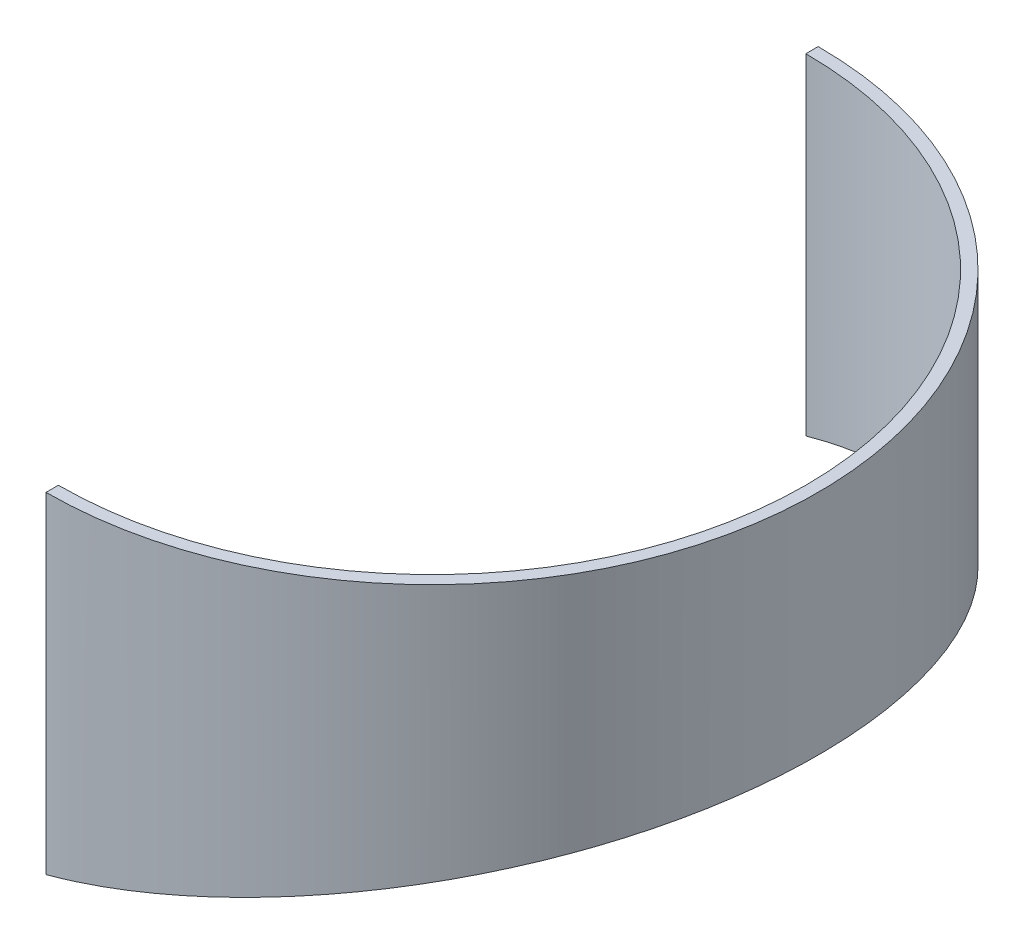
ISO-10303-21;
HEADER;
FILE_DESCRIPTION(('STEP AP214'),'2;1');
FILE_NAME('part.step','',(''),(''),'','','');
FILE_SCHEMA(('AUTOMOTIVE_DESIGN { 1 0 10303 214 1 1 1 1 }'));
ENDSEC;
DATA;
#1=APPLICATION_CONTEXT('core data for automotive mechanical design processes');
#2=APPLICATION_PROTOCOL_DEFINITION('international standard','automotive_design',2000,#1);
#3=PRODUCT_CONTEXT('',#1,'mechanical');
#4=PRODUCT('Part','Part','',(#3));
#5=PRODUCT_RELATED_PRODUCT_CATEGORY('part','',(#4));
#6=PRODUCT_DEFINITION_FORMATION('','',#4);
#7=PRODUCT_DEFINITION_CONTEXT('part definition',#1,'design');
#8=PRODUCT_DEFINITION('design','',#6,#7);
#9=PRODUCT_DEFINITION_SHAPE('','',#8);
#10=(LENGTH_UNIT() NAMED_UNIT(*) SI_UNIT(.MILLI.,.METRE.));
#11=(NAMED_UNIT(*) PLANE_ANGLE_UNIT() SI_UNIT($,.RADIAN.));
#12=(NAMED_UNIT(*) SI_UNIT($,.STERADIAN.) SOLID_ANGLE_UNIT());
#13=UNCERTAINTY_MEASURE_WITH_UNIT(LENGTH_MEASURE(1.E-05),#10,'distance_accuracy_value','');
#14=(GEOMETRIC_REPRESENTATION_CONTEXT(3) GLOBAL_UNCERTAINTY_ASSIGNED_CONTEXT((#13)) GLOBAL_UNIT_ASSIGNED_CONTEXT((#10,
#11,#12)) REPRESENTATION_CONTEXT('',''));
#15=CARTESIAN_POINT('',(0.,0.,0.));
#16=DIRECTION('',(0.,0.,1.));
#17=DIRECTION('',(1.,0.,0.));
#18=AXIS2_PLACEMENT_3D('',#15,#16,#17);
#19=CARTESIAN_POINT('',(0.,-214.3593539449,250.000000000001));
#20=CARTESIAN_POINT('',(7.19258735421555,-212.432107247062,250.000000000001));
#21=CARTESIAN_POINT('',(13.1735641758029,-210.83017860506,249.698401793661));
#22=CARTESIAN_POINT('',(19.1313672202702,-209.233420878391,249.269769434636));
#23=CARTESIAN_POINT('',(20.247096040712,-208.934368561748,249.180947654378));
#24=CARTESIAN_POINT('',(22.3271655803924,-208.376862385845,249.003187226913));
#25=CARTESIAN_POINT('',(23.2862334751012,-208.119826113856,248.914762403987));
#26=CARTESIAN_POINT('',(25.9696100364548,-207.400818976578,248.653996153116));
#27=CARTESIAN_POINT('',(27.7208266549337,-206.931620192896,248.464348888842));
#28=CARTESIAN_POINT('',(32.8609338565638,-205.554441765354,247.854930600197));
#29=CARTESIAN_POINT('',(36.1362115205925,-204.676880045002,247.394781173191));
#30=CARTESIAN_POINT('',(42.3833979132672,-203.002871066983,246.401402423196));
#31=CARTESIAN_POINT('',(45.3506135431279,-202.207690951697,245.86910344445));
#32=CARTESIAN_POINT('',(53.8285556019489,-199.936042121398,244.20414269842));
#33=CARTESIAN_POINT('',(59.2087208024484,-198.494564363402,242.944971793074));
#34=CARTESIAN_POINT('',(66.8694890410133,-196.441779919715,240.905488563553));
#35=CARTESIAN_POINT('',(69.3523493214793,-195.776447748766,240.201240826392));
#36=CARTESIAN_POINT('',(74.1931083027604,-194.479372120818,238.750428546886));
#37=CARTESIAN_POINT('',(76.570731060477,-193.842322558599,237.997850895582));
#38=CARTESIAN_POINT('',(83.5748256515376,-191.965638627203,235.668122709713));
#39=CARTESIAN_POINT('',(88.0723896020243,-190.76046901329,234.019081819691));
#40=CARTESIAN_POINT('',(94.5615957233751,-189.021644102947,231.437947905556));
#41=CARTESIAN_POINT('',(96.6836253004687,-188.45307163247,230.559083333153));
#42=CARTESIAN_POINT('',(100.878970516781,-187.329099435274,228.754557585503));
#43=CARTESIAN_POINT('',(102.947723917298,-186.774898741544,227.830676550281));
#44=CARTESIAN_POINT('',(113.146067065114,-184.042822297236,223.111595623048));
#45=CARTESIAN_POINT('',(120.838100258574,-181.981727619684,219.01811857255));
#46=CARTESIAN_POINT('',(131.67646962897,-179.076935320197,212.553529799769));
#47=CARTESIAN_POINT('',(135.1666130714,-178.141532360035,210.348683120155));
#48=CARTESIAN_POINT('',(141.945534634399,-176.325220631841,205.83499939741));
#49=CARTESIAN_POINT('',(145.248408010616,-175.44041689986,203.516271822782));
#50=CARTESIAN_POINT('',(154.895093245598,-172.856062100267,196.396033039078));
#51=CARTESIAN_POINT('',(160.976524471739,-171.226567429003,191.430708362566));
#52=CARTESIAN_POINT('',(172.439890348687,-168.154395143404,181.172960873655));
#53=CARTESIAN_POINT('',(177.811972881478,-166.714766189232,175.893226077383));
#54=CARTESIAN_POINT('',(187.972342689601,-163.992661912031,164.99067568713));
#55=CARTESIAN_POINT('',(192.748282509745,-162.713096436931,159.37698959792));
#56=CARTESIAN_POINT('',(201.689976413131,-160.31693881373,147.898879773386));
#57=CARTESIAN_POINT('',(205.849804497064,-159.202023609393,142.044033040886));
#58=CARTESIAN_POINT('',(213.597120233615,-157.12633777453,130.103495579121));
#59=CARTESIAN_POINT('',(217.186930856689,-156.164681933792,124.012087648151));
#60=CARTESIAN_POINT('',(223.796129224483,-154.393744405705,111.644316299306));
#61=CARTESIAN_POINT('',(226.815532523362,-153.584462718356,105.3679681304));
#62=CARTESIAN_POINT('',(232.286657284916,-152.118273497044,92.6855077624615));
#63=CARTESIAN_POINT('',(234.745014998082,-151.459765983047,86.2649150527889));
#64=CARTESIAN_POINT('',(239.113801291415,-150.289339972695,73.2901607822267));
#65=CARTESIAN_POINT('',(241.022618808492,-149.77782948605,66.7397143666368));
#66=CARTESIAN_POINT('',(244.28954812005,-148.902213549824,53.5603298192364));
#67=CARTESIAN_POINT('',(245.647150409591,-148.538374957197,46.9367109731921));
#68=CARTESIAN_POINT('',(248.909858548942,-147.664442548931,26.947943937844));
#69=CARTESIAN_POINT('',(249.997338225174,-147.372773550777,13.4809853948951));
#70=CARTESIAN_POINT('',(250.002651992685,-147.371340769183,-13.3820806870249));
#71=CARTESIAN_POINT('',(248.920528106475,-147.661588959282,-26.8492803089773));
#72=CARTESIAN_POINT('',(245.665698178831,-148.533408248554,-46.8395455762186));
#73=CARTESIAN_POINT('',(244.310719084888,-148.896536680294,-53.4636835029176));
#74=CARTESIAN_POINT('',(241.048977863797,-149.770768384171,-66.6444535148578));
#75=CARTESIAN_POINT('',(239.14270551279,-150.281604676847,-73.1958199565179));
#76=CARTESIAN_POINT('',(234.778835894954,-151.450718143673,-86.1728488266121));
#77=CARTESIAN_POINT('',(232.322790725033,-152.108596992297,-92.5949246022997));
#78=CARTESIAN_POINT('',(226.856328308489,-153.573515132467,-105.280128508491));
#79=CARTESIAN_POINT('',(223.839093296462,-154.382224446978,-111.558207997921));
#80=CARTESIAN_POINT('',(217.233760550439,-156.152143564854,-123.930088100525));
#81=CARTESIAN_POINT('',(213.645647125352,-157.113353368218,-130.023873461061));
#82=CARTESIAN_POINT('',(205.901118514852,-159.188273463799,-141.969713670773));
#83=CARTESIAN_POINT('',(201.742591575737,-160.302820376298,-147.827187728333));
#84=CARTESIAN_POINT('',(192.802749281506,-162.698488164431,-159.311175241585));
#85=CARTESIAN_POINT('',(188.027388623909,-163.977910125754,-164.928047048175));
#86=CARTESIAN_POINT('',(177.867360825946,-166.699930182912,-175.837315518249));
#87=CARTESIAN_POINT('',(172.495171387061,-168.139577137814,-181.12043109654));
#88=CARTESIAN_POINT('',(161.03123390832,-171.211904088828,-191.384786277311));
#89=CARTESIAN_POINT('',(154.949163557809,-172.841575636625,-196.353491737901));
#90=CARTESIAN_POINT('',(145.300937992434,-175.426345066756,-203.478799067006));
#91=CARTESIAN_POINT('',(141.997454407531,-176.311311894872,-205.799215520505));
#92=CARTESIAN_POINT('',(135.217112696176,-178.127999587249,-210.316253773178));
#93=CARTESIAN_POINT('',(131.726601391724,-179.063498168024,-212.522491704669));
#94=CARTESIAN_POINT('',(120.886259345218,-181.968820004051,-218.991644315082));
#95=CARTESIAN_POINT('',(113.192419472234,-184.030405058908,-223.088219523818));
#96=CARTESIAN_POINT('',(102.991149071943,-186.763266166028,-227.811057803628));
#97=CARTESIAN_POINT('',(100.921776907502,-187.317632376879,-228.735684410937));
#98=CARTESIAN_POINT('',(96.7251267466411,-188.441952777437,-230.541684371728));
#99=CARTESIAN_POINT('',(94.6023898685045,-189.010713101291,-231.42128360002));
#100=CARTESIAN_POINT('',(88.1115026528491,-190.749987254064,-234.004388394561));
#101=CARTESIAN_POINT('',(83.6125495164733,-191.955530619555,-235.654783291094));
#102=CARTESIAN_POINT('',(76.605949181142,-193.832886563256,-237.986527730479));
#103=CARTESIAN_POINT('',(74.2274209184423,-194.470178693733,-238.739774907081));
#104=CARTESIAN_POINT('',(69.384708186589,-195.767776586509,-240.191907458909));
#105=CARTESIAN_POINT('',(66.9011889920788,-196.433284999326,-240.896699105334));
#106=CARTESIAN_POINT('',(59.2375304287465,-198.486844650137,-242.937996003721));
#107=CARTESIAN_POINT('',(53.8549921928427,-199.928959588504,-244.198384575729));
#108=CARTESIAN_POINT('',(45.3728030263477,-202.201744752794,-245.865027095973));
#109=CARTESIAN_POINT('',(42.4048202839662,-202.997130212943,-246.397735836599));
#110=CARTESIAN_POINT('',(36.1547568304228,-204.671910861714,-247.392090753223));
#111=CARTESIAN_POINT('',(32.8777932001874,-205.549924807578,-247.852722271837));
#112=CARTESIAN_POINT('',(27.7347824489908,-206.927881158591,-248.462798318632));
#113=CARTESIAN_POINT('',(25.9825355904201,-207.397355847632,-248.652653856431));
#114=CARTESIAN_POINT('',(23.2975201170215,-208.116801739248,-248.913708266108));
#115=CARTESIAN_POINT('',(22.3388885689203,-208.373720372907,-249.00213660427));
#116=CARTESIAN_POINT('',(20.2584416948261,-208.93132746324,-249.18002631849));
#117=CARTESIAN_POINT('',(19.1424087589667,-209.230461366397,-249.268923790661));
#118=CARTESIAN_POINT('',(13.1825054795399,-210.82778267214,-249.697962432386));
#119=CARTESIAN_POINT('',(7.19799007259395,-212.430659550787,-249.999999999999));
#120=CARTESIAN_POINT('',(0.,-214.3593539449,-249.999999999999));
#121=CARTESIAN_POINT('',(0.,-214.3593539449,242.000000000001));
#122=CARTESIAN_POINT('',(6.96242026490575,-212.432108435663,242.000000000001));
#123=CARTESIAN_POINT('',(12.7520101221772,-210.83017860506,241.708052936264));
#124=CARTESIAN_POINT('',(18.5191634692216,-209.233420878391,241.293136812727));
#125=CARTESIAN_POINT('',(19.5991889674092,-208.934368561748,241.207157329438));
#126=CARTESIAN_POINT('',(21.6126962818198,-208.376862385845,241.035085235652));
#127=CARTESIAN_POINT('',(22.5410740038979,-208.119826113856,240.94949000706));
#128=CARTESIAN_POINT('',(25.1385825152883,-207.400818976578,240.697068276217));
#129=CARTESIAN_POINT('',(26.8337602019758,-206.931620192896,240.513489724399));
#130=CARTESIAN_POINT('',(31.8093839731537,-205.554441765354,239.923572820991));
#131=CARTESIAN_POINT('',(34.9798527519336,-204.676880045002,239.478148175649));
#132=CARTESIAN_POINT('',(41.0271291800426,-203.002871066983,238.516557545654));
#133=CARTESIAN_POINT('',(43.8993939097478,-202.207690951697,238.001292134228));
#134=CARTESIAN_POINT('',(52.1060418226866,-199.936042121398,236.38961013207));
#135=CARTESIAN_POINT('',(57.3140417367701,-198.494564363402,235.170732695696));
#136=CARTESIAN_POINT('',(64.7296653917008,-196.441779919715,233.196512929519));
#137=CARTESIAN_POINT('',(67.1330741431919,-195.776447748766,232.514801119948));
#138=CARTESIAN_POINT('',(71.8189288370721,-194.479372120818,231.110414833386));
#139=CARTESIAN_POINT('',(74.1204676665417,-193.842322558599,230.381919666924));
#140=CARTESIAN_POINT('',(80.9004312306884,-191.965638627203,228.126742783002));
#141=CARTESIAN_POINT('',(85.2540731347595,-190.76046901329,226.530471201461));
#142=CARTESIAN_POINT('',(91.5356246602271,-189.021644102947,224.031933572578));
#143=CARTESIAN_POINT('',(93.5897492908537,-188.453071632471,223.181192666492));
#144=CARTESIAN_POINT('',(97.6508434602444,-187.329099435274,221.434411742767));
#145=CARTESIAN_POINT('',(99.6533967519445,-186.774898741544,220.540094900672));
#146=CARTESIAN_POINT('',(109.52539291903,-184.042822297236,215.972024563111));
#147=CARTESIAN_POINT('',(116.971281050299,-181.981727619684,212.009538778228));
#148=CARTESIAN_POINT('',(127.462822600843,-179.076935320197,205.751816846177));
#149=CARTESIAN_POINT('',(130.841281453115,-178.141532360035,203.61752526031));
#150=CARTESIAN_POINT('',(137.403277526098,-176.325220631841,199.248279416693));
#151=CARTESIAN_POINT('',(140.600458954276,-175.44041689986,197.003751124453));
#152=CARTESIAN_POINT('',(149.938450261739,-172.856062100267,190.111359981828));
#153=CARTESIAN_POINT('',(155.825275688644,-171.226567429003,185.304925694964));
#154=CARTESIAN_POINT('',(166.921813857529,-168.154395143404,175.375426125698));
#155=CARTESIAN_POINT('',(172.12198974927,-166.714766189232,170.264642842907));
#156=CARTESIAN_POINT('',(181.957227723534,-163.992661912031,159.710974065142));
#157=CARTESIAN_POINT('',(186.580337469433,-162.713096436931,154.276925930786));
#158=CARTESIAN_POINT('',(195.235897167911,-160.31693881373,143.166115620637));
#159=CARTESIAN_POINT('',(199.262610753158,-159.202023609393,137.498623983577));
#160=CARTESIAN_POINT('',(206.762012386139,-157.12633777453,125.940183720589));
#161=CARTESIAN_POINT('',(210.236949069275,-156.164681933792,120.043700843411));
#162=CARTESIAN_POINT('',(216.634653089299,-154.393744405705,108.071698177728));
#163=CARTESIAN_POINT('',(219.557435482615,-153.584462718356,101.996193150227));
#164=CARTESIAN_POINT('',(224.853484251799,-152.118273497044,89.7195715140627));
#165=CARTESIAN_POINT('',(227.233174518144,-151.459765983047,83.5044377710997));
#166=CARTESIAN_POINT('',(231.462159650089,-150.289339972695,70.9448756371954));
#167=CARTESIAN_POINT('',(233.30989500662,-149.77782948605,64.6040435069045));
#168=CARTESIAN_POINT('',(236.472282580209,-148.902213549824,51.8463992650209));
#169=CARTESIAN_POINT('',(237.786441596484,-148.538374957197,45.43473622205));
#170=CARTESIAN_POINT('',(240.944743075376,-147.664442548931,26.085609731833));
#171=CARTESIAN_POINT('',(241.997423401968,-147.372773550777,13.0495938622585));
#172=CARTESIAN_POINT('',(242.002567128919,-147.371340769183,-12.9538541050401));
#173=CARTESIAN_POINT('',(240.955071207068,-147.661588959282,-25.99010333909));
#174=CARTESIAN_POINT('',(237.804395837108,-148.533408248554,-45.3406801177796));
#175=CARTESIAN_POINT('',(236.492776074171,-148.896536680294,-51.7528456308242));
#176=CARTESIAN_POINT('',(233.335410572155,-149.770768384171,-64.5118310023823));
#177=CARTESIAN_POINT('',(231.490138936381,-150.281604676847,-70.8535537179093));
#178=CARTESIAN_POINT('',(227.265913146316,-151.450718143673,-83.4153176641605));
#179=CARTESIAN_POINT('',(224.888461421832,-152.108596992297,-89.631887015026));
#180=CARTESIAN_POINT('',(219.596925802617,-153.573515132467,-101.911164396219));
#181=CARTESIAN_POINT('',(216.676242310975,-154.382224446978,-107.988345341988));
#182=CARTESIAN_POINT('',(210.282280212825,-156.152143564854,-119.964325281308));
#183=CARTESIAN_POINT('',(206.808986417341,-157.113353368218,-125.863109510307));
#184=CARTESIAN_POINT('',(199.312282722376,-159.188273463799,-137.426682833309));
#185=CARTESIAN_POINT('',(195.286828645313,-160.302820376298,-143.096717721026));
#186=CARTESIAN_POINT('',(186.633061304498,-162.698488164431,-154.213217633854));
#187=CARTESIAN_POINT('',(182.010512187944,-163.977910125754,-159.650349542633));
#188=CARTESIAN_POINT('',(172.175605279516,-166.699930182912,-170.210521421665));
#189=CARTESIAN_POINT('',(166.975325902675,-168.139577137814,-175.324577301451));
#190=CARTESIAN_POINT('',(155.878234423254,-171.211904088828,-185.260473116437));
#191=CARTESIAN_POINT('',(149.990790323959,-172.841575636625,-190.070180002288));
#192=CARTESIAN_POINT('',(140.651307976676,-175.426345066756,-196.967477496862));
#193=CARTESIAN_POINT('',(137.45353586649,-176.311311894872,-199.213640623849));
#194=CARTESIAN_POINT('',(130.890165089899,-178.127999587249,-203.586133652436));
#195=CARTESIAN_POINT('',(127.511350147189,-179.063498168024,-205.72177197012));
#196=CARTESIAN_POINT('',(117.017899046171,-181.968820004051,-211.983911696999));
#197=CARTESIAN_POINT('',(109.570262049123,-184.030405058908,-215.949396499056));
#198=CARTESIAN_POINT('',(99.6954323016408,-186.763266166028,-220.521103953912));
#199=CARTESIAN_POINT('',(97.6922800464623,-187.317632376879,-221.416142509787));
#200=CARTESIAN_POINT('',(93.6299226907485,-188.441952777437,-223.164350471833));
#201=CARTESIAN_POINT('',(91.5751133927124,-189.010713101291,-224.015802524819));
#202=CARTESIAN_POINT('',(85.2919345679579,-190.749987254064,-226.516247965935));
#203=CARTESIAN_POINT('',(80.9369479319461,-191.955530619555,-228.113830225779));
#204=CARTESIAN_POINT('',(74.1545588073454,-193.832886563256,-230.370958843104));
#205=CARTESIAN_POINT('',(71.8521434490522,-194.470178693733,-231.100102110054));
#206=CARTESIAN_POINT('',(67.1643975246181,-195.767776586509,-232.505766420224));
#207=CARTESIAN_POINT('',(64.7603509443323,-196.433284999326,-233.188004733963));
#208=CARTESIAN_POINT('',(57.3419294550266,-198.486844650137,-235.163980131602));
#209=CARTESIAN_POINT('',(52.1316324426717,-199.928959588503,-236.384036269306));
#210=CARTESIAN_POINT('',(43.9208733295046,-202.201744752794,-237.997346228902));
#211=CARTESIAN_POINT('',(41.0478660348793,-202.997130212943,-238.513008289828));
#212=CARTESIAN_POINT('',(34.9978046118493,-204.671910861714,-239.475543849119));
#213=CARTESIAN_POINT('',(31.8257038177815,-205.549924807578,-239.921435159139));
#214=CARTESIAN_POINT('',(26.8472694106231,-206.927881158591,-240.511988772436));
#215=CARTESIAN_POINT('',(25.1510944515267,-207.397355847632,-240.695768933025));
#216=CARTESIAN_POINT('',(22.5519994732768,-208.116801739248,-240.948469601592));
#217=CARTESIAN_POINT('',(21.6240441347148,-208.373720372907,-241.034068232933));
#218=CARTESIAN_POINT('',(19.6101715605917,-208.93132746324,-241.206265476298));
#219=CARTESIAN_POINT('',(18.5298516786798,-209.230461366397,-241.29231822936));
#220=CARTESIAN_POINT('',(12.7606653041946,-210.82778267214,-241.70762763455));
#221=CARTESIAN_POINT('',(6.96765008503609,-212.430660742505,-241.999999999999));
#222=CARTESIAN_POINT('',(0.,-214.3593539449,-241.999999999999));
#223=B_SPLINE_SURFACE_WITH_KNOTS('',1,3,((#19,#20,#21,#22,#23,#24,#25,#26,#27,#28,#29,#30,#31,
#32,#33,#34,#35,#36,#37,#38,#39,#40,#41,#42,#43,#44,#45,#46,#47,#48,#49,#50,#51,#52,#53,#54,#55,
#56,#57,#58,#59,#60,#61,#62,#63,#64,#65,#66,#67,#68,#69,#70,#71,#72,#73,#74,#75,#76,#77,#78,#79,
#80,#81,#82,#83,#84,#85,#86,#87,#88,#89,#90,#91,#92,#93,#94,#95,#96,#97,#98,#99,#100,#101,#102,
#103,#104,#105,#106,#107,#108,#109,#110,#111,#112,#113,#114,#115,#116,#117,#118,#119,#120),
(#121,#122,#123,#124,#125,#126,#127,#128,#129,#130,#131,#132,#133,#134,#135,#136,#137,#138,#139,
#140,#141,#142,#143,#144,#145,#146,#147,#148,#149,#150,#151,#152,#153,#154,#155,#156,#157,#158,
#159,#160,#161,#162,#163,#164,#165,#166,#167,#168,#169,#170,#171,#172,#173,#174,#175,#176,#177,
#178,#179,#180,#181,#182,#183,#184,#185,#186,#187,#188,#189,#190,#191,#192,#193,#194,#195,#196,
#197,#198,#199,#200,#201,#202,#203,#204,#205,#206,#207,#208,#209,#210,#211,#212,#213,#214,#215,
#216,#217,#218,#219,#220,#221,#222)),.UNSPECIFIED.,.F.,.F.,.F.,(2,2),(4,2,2,2,2,2,2,2,2,2,2,2,2,
2,2,2,2,2,2,2,2,2,2,2,2,2,2,2,2,2,2,2,2,2,2,2,2,2,2,2,2,2,2,2,2,2,2,2,2,2,4),(0.,1.),(0.,
0.0078125,0.009765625,0.01171875,0.015625,0.0234375,0.03125,0.046875,0.0546875,0.0625,0.078125,
0.0859375,0.09375,0.125,0.140625,0.15625,0.1875,0.21875,0.25,0.28125,0.3125,0.34375,0.375,
0.40625,0.4375,0.5,0.5625,0.59375,0.625,0.65625,0.6875,0.71875,0.75,0.78125,0.8125,0.84375,
0.859375,0.875,0.90625,0.9140625,0.921875,0.9375,0.9453125,0.953125,0.96875,0.9765625,0.984375,
0.98828125,0.990234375,0.9921875,1.),.UNSPECIFIED.);
#224=CARTESIAN_POINT('',(0.,-214.3593539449,250.000000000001));
#225=CARTESIAN_POINT('',(0.,-214.3593539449,242.000000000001));
#226=B_SPLINE_CURVE_WITH_KNOTS('',1,(#224,#225),.UNSPECIFIED.,.F.,.F.,(2,2),(0.,1.),.UNSPECIFIED.);
#227=CARTESIAN_POINT('',(0.,-214.3593539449,242.000000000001));
#228=VERTEX_POINT('',#227);
#229=CARTESIAN_POINT('',(0.,-214.3593539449,250.000000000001));
#230=VERTEX_POINT('',#229);
#231=EDGE_CURVE('E13',#228,#230,#226,.F.);
#232=CARTESIAN_POINT('',(0.,-214.3593539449,242.000000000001));
#233=CARTESIAN_POINT('',(6.96242026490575,-212.432108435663,242.000000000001));
#234=CARTESIAN_POINT('',(12.7520101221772,-210.83017860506,241.708052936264));
#235=CARTESIAN_POINT('',(18.5191634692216,-209.233420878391,241.293136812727));
#236=CARTESIAN_POINT('',(19.5991889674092,-208.934368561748,241.207157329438));
#237=CARTESIAN_POINT('',(21.6126962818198,-208.376862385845,241.035085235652));
#238=CARTESIAN_POINT('',(22.5410740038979,-208.119826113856,240.94949000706));
#239=CARTESIAN_POINT('',(25.1385825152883,-207.400818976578,240.697068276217));
#240=CARTESIAN_POINT('',(26.8337602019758,-206.931620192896,240.513489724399));
#241=CARTESIAN_POINT('',(31.8093839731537,-205.554441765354,239.923572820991));
#242=CARTESIAN_POINT('',(34.9798527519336,-204.676880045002,239.478148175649));
#243=CARTESIAN_POINT('',(41.0271291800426,-203.002871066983,238.516557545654));
#244=CARTESIAN_POINT('',(43.8993939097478,-202.207690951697,238.001292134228));
#245=CARTESIAN_POINT('',(52.1060418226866,-199.936042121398,236.38961013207));
#246=CARTESIAN_POINT('',(57.3140417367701,-198.494564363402,235.170732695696));
#247=CARTESIAN_POINT('',(64.7296653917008,-196.441779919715,233.196512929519));
#248=CARTESIAN_POINT('',(67.1330741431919,-195.776447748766,232.514801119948));
#249=CARTESIAN_POINT('',(71.8189288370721,-194.479372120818,231.110414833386));
#250=CARTESIAN_POINT('',(74.1204676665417,-193.842322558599,230.381919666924));
#251=CARTESIAN_POINT('',(80.9004312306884,-191.965638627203,228.126742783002));
#252=CARTESIAN_POINT('',(85.2540731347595,-190.76046901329,226.530471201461));
#253=CARTESIAN_POINT('',(91.5356246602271,-189.021644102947,224.031933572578));
#254=CARTESIAN_POINT('',(93.5897492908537,-188.453071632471,223.181192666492));
#255=CARTESIAN_POINT('',(97.6508434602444,-187.329099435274,221.434411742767));
#256=CARTESIAN_POINT('',(99.6533967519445,-186.774898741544,220.540094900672));
#257=CARTESIAN_POINT('',(109.52539291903,-184.042822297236,215.972024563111));
#258=CARTESIAN_POINT('',(116.971281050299,-181.981727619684,212.009538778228));
#259=CARTESIAN_POINT('',(127.462822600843,-179.076935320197,205.751816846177));
#260=CARTESIAN_POINT('',(130.841281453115,-178.141532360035,203.61752526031));
#261=CARTESIAN_POINT('',(137.403277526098,-176.325220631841,199.248279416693));
#262=CARTESIAN_POINT('',(140.600458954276,-175.44041689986,197.003751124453));
#263=CARTESIAN_POINT('',(149.938450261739,-172.856062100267,190.111359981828));
#264=CARTESIAN_POINT('',(155.825275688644,-171.226567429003,185.304925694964));
#265=CARTESIAN_POINT('',(166.921813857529,-168.154395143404,175.375426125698));
#266=CARTESIAN_POINT('',(172.12198974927,-166.714766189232,170.264642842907));
#267=CARTESIAN_POINT('',(181.957227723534,-163.992661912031,159.710974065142));
#268=CARTESIAN_POINT('',(186.580337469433,-162.713096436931,154.276925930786));
#269=CARTESIAN_POINT('',(195.235897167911,-160.31693881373,143.166115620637));
#270=CARTESIAN_POINT('',(199.262610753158,-159.202023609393,137.498623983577));
#271=CARTESIAN_POINT('',(206.762012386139,-157.12633777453,125.940183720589));
#272=CARTESIAN_POINT('',(210.236949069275,-156.164681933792,120.043700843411));
#273=CARTESIAN_POINT('',(216.634653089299,-154.393744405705,108.071698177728));
#274=CARTESIAN_POINT('',(219.557435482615,-153.584462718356,101.996193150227));
#275=CARTESIAN_POINT('',(224.853484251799,-152.118273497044,89.7195715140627));
#276=CARTESIAN_POINT('',(227.233174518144,-151.459765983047,83.5044377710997));
#277=CARTESIAN_POINT('',(231.462159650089,-150.289339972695,70.9448756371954));
#278=CARTESIAN_POINT('',(233.30989500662,-149.77782948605,64.6040435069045));
#279=CARTESIAN_POINT('',(236.472282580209,-148.902213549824,51.8463992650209));
#280=CARTESIAN_POINT('',(237.786441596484,-148.538374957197,45.43473622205));
#281=CARTESIAN_POINT('',(240.944743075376,-147.664442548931,26.085609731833));
#282=CARTESIAN_POINT('',(241.997423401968,-147.372773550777,13.0495938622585));
#283=CARTESIAN_POINT('',(242.002567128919,-147.371340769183,-12.9538541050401));
#284=CARTESIAN_POINT('',(240.955071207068,-147.661588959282,-25.99010333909));
#285=CARTESIAN_POINT('',(237.804395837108,-148.533408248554,-45.3406801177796));
#286=CARTESIAN_POINT('',(236.492776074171,-148.896536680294,-51.7528456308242));
#287=CARTESIAN_POINT('',(233.335410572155,-149.770768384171,-64.5118310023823));
#288=CARTESIAN_POINT('',(231.490138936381,-150.281604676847,-70.8535537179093));
#289=CARTESIAN_POINT('',(227.265913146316,-151.450718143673,-83.4153176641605));
#290=CARTESIAN_POINT('',(224.888461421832,-152.108596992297,-89.631887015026));
#291=CARTESIAN_POINT('',(219.596925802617,-153.573515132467,-101.911164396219));
#292=CARTESIAN_POINT('',(216.676242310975,-154.382224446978,-107.988345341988));
#293=CARTESIAN_POINT('',(210.282280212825,-156.152143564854,-119.964325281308));
#294=CARTESIAN_POINT('',(206.808986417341,-157.113353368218,-125.863109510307));
#295=CARTESIAN_POINT('',(199.312282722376,-159.188273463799,-137.426682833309));
#296=CARTESIAN_POINT('',(195.286828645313,-160.302820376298,-143.096717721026));
#297=CARTESIAN_POINT('',(186.633061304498,-162.698488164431,-154.213217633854));
#298=CARTESIAN_POINT('',(182.010512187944,-163.977910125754,-159.650349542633));
#299=CARTESIAN_POINT('',(172.175605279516,-166.699930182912,-170.210521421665));
#300=CARTESIAN_POINT('',(166.975325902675,-168.139577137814,-175.324577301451));
#301=CARTESIAN_POINT('',(155.878234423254,-171.211904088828,-185.260473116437));
#302=CARTESIAN_POINT('',(149.990790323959,-172.841575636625,-190.070180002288));
#303=CARTESIAN_POINT('',(140.651307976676,-175.426345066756,-196.967477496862));
#304=CARTESIAN_POINT('',(137.45353586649,-176.311311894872,-199.213640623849));
#305=CARTESIAN_POINT('',(130.890165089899,-178.127999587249,-203.586133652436));
#306=CARTESIAN_POINT('',(127.511350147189,-179.063498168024,-205.72177197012));
#307=CARTESIAN_POINT('',(117.017899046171,-181.968820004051,-211.983911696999));
#308=CARTESIAN_POINT('',(109.570262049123,-184.030405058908,-215.949396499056));
#309=CARTESIAN_POINT('',(99.6954323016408,-186.763266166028,-220.521103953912));
#310=CARTESIAN_POINT('',(97.6922800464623,-187.317632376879,-221.416142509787));
#311=CARTESIAN_POINT('',(93.6299226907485,-188.441952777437,-223.164350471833));
#312=CARTESIAN_POINT('',(91.5751133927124,-189.010713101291,-224.015802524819));
#313=CARTESIAN_POINT('',(85.2919345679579,-190.749987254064,-226.516247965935));
#314=CARTESIAN_POINT('',(80.9369479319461,-191.955530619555,-228.113830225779));
#315=CARTESIAN_POINT('',(74.1545588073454,-193.832886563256,-230.370958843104));
#316=CARTESIAN_POINT('',(71.8521434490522,-194.470178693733,-231.100102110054));
#317=CARTESIAN_POINT('',(67.1643975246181,-195.767776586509,-232.505766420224));
#318=CARTESIAN_POINT('',(64.7603509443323,-196.433284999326,-233.188004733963));
#319=CARTESIAN_POINT('',(57.3419294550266,-198.486844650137,-235.163980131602));
#320=CARTESIAN_POINT('',(52.1316324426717,-199.928959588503,-236.384036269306));
#321=CARTESIAN_POINT('',(43.9208733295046,-202.201744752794,-237.997346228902));
#322=CARTESIAN_POINT('',(41.0478660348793,-202.997130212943,-238.513008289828));
#323=CARTESIAN_POINT('',(34.9978046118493,-204.671910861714,-239.475543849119));
#324=CARTESIAN_POINT('',(31.8257038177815,-205.549924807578,-239.921435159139));
#325=CARTESIAN_POINT('',(26.8472694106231,-206.927881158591,-240.511988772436));
#326=CARTESIAN_POINT('',(25.1510944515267,-207.397355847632,-240.695768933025));
#327=CARTESIAN_POINT('',(22.5519994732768,-208.116801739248,-240.948469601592));
#328=CARTESIAN_POINT('',(21.6240441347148,-208.373720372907,-241.034068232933));
#329=CARTESIAN_POINT('',(19.6101715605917,-208.93132746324,-241.206265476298));
#330=CARTESIAN_POINT('',(18.5298516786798,-209.230461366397,-241.29231822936));
#331=CARTESIAN_POINT('',(12.7606653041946,-210.82778267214,-241.70762763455));
#332=CARTESIAN_POINT('',(6.96765008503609,-212.430660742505,-241.999999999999));
#333=CARTESIAN_POINT('',(0.,-214.3593539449,-241.999999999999));
#334=B_SPLINE_CURVE_WITH_KNOTS('',3,(#232,#233,#234,#235,#236,#237,#238,#239,#240,#241,#242,
#243,#244,#245,#246,#247,#248,#249,#250,#251,#252,#253,#254,#255,#256,#257,#258,#259,#260,#261,
#262,#263,#264,#265,#266,#267,#268,#269,#270,#271,#272,#273,#274,#275,#276,#277,#278,#279,#280,
#281,#282,#283,#284,#285,#286,#287,#288,#289,#290,#291,#292,#293,#294,#295,#296,#297,#298,#299,
#300,#301,#302,#303,#304,#305,#306,#307,#308,#309,#310,#311,#312,#313,#314,#315,#316,#317,#318,
#319,#320,#321,#322,#323,#324,#325,#326,#327,#328,#329,#330,#331,#332,#333),.UNSPECIFIED.,.F.,
.F.,(4,2,2,2,2,2,2,2,2,2,2,2,2,2,2,2,2,2,2,2,2,2,2,2,2,2,2,2,2,2,2,2,2,2,2,2,2,2,2,2,2,2,2,2,2,
2,2,2,2,2,4),(0.,0.0078125,0.009765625,0.01171875,0.015625,0.0234375,0.03125,0.046875,0.0546875,
0.0625,0.078125,0.0859375,0.09375,0.125,0.140625,0.15625,0.1875,0.21875,0.25,0.28125,0.3125,
0.34375,0.375,0.40625,0.4375,0.5,0.5625,0.59375,0.625,0.65625,0.6875,0.71875,0.75,0.78125,
0.8125,0.84375,0.859375,0.875,0.90625,0.9140625,0.921875,0.9375,0.9453125,0.953125,0.96875,
0.9765625,0.984375,0.98828125,0.990234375,0.9921875,1.),.UNSPECIFIED.);
#335=CARTESIAN_POINT('',(-1.58240737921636E-12,-214.3593539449,-241.999999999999));
#336=VERTEX_POINT('',#335);
#337=EDGE_CURVE('E109',#228,#336,#334,.T.);
#338=CARTESIAN_POINT('',(0.,-214.3593539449,-241.999999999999));
#339=CARTESIAN_POINT('',(0.,-214.3593539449,-249.999999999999));
#340=B_SPLINE_CURVE_WITH_KNOTS('',1,(#338,#339),.UNSPECIFIED.,.F.,.F.,(2,2),(0.,1.),.UNSPECIFIED.);
#341=CARTESIAN_POINT('',(0.,-214.3593539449,-249.999999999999));
#342=VERTEX_POINT('',#341);
#343=EDGE_CURVE('E47',#336,#342,#340,.T.);
#344=CARTESIAN_POINT('',(0.,-214.3593539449,-249.999999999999));
#345=CARTESIAN_POINT('',(7.19799007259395,-212.430659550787,-249.999999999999));
#346=CARTESIAN_POINT('',(13.1825054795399,-210.82778267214,-249.697962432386));
#347=CARTESIAN_POINT('',(19.1424087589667,-209.230461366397,-249.268923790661));
#348=CARTESIAN_POINT('',(20.2584416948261,-208.93132746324,-249.18002631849));
#349=CARTESIAN_POINT('',(22.3388885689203,-208.373720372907,-249.00213660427));
#350=CARTESIAN_POINT('',(23.2975201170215,-208.116801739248,-248.913708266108));
#351=CARTESIAN_POINT('',(25.9825355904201,-207.397355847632,-248.652653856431));
#352=CARTESIAN_POINT('',(27.7347824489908,-206.927881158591,-248.462798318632));
#353=CARTESIAN_POINT('',(32.8777932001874,-205.549924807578,-247.852722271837));
#354=CARTESIAN_POINT('',(36.1547568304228,-204.671910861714,-247.392090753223));
#355=CARTESIAN_POINT('',(42.4048202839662,-202.997130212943,-246.397735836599));
#356=CARTESIAN_POINT('',(45.3728030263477,-202.201744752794,-245.865027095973));
#357=CARTESIAN_POINT('',(53.8549921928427,-199.928959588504,-244.198384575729));
#358=CARTESIAN_POINT('',(59.2375304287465,-198.486844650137,-242.937996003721));
#359=CARTESIAN_POINT('',(66.9011889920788,-196.433284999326,-240.896699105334));
#360=CARTESIAN_POINT('',(69.384708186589,-195.767776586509,-240.191907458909));
#361=CARTESIAN_POINT('',(74.2274209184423,-194.470178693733,-238.739774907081));
#362=CARTESIAN_POINT('',(76.605949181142,-193.832886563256,-237.986527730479));
#363=CARTESIAN_POINT('',(83.6125495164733,-191.955530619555,-235.654783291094));
#364=CARTESIAN_POINT('',(88.1115026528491,-190.749987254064,-234.004388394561));
#365=CARTESIAN_POINT('',(94.6023898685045,-189.010713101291,-231.42128360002));
#366=CARTESIAN_POINT('',(96.7251267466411,-188.441952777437,-230.541684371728));
#367=CARTESIAN_POINT('',(100.921776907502,-187.317632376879,-228.735684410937));
#368=CARTESIAN_POINT('',(102.991149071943,-186.763266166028,-227.811057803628));
#369=CARTESIAN_POINT('',(113.192419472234,-184.030405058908,-223.088219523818));
#370=CARTESIAN_POINT('',(120.886259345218,-181.968820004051,-218.991644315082));
#371=CARTESIAN_POINT('',(131.726601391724,-179.063498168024,-212.522491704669));
#372=CARTESIAN_POINT('',(135.217112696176,-178.127999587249,-210.316253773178));
#373=CARTESIAN_POINT('',(141.997454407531,-176.311311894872,-205.799215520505));
#374=CARTESIAN_POINT('',(145.300937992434,-175.426345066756,-203.478799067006));
#375=CARTESIAN_POINT('',(154.949163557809,-172.841575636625,-196.353491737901));
#376=CARTESIAN_POINT('',(161.03123390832,-171.211904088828,-191.384786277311));
#377=CARTESIAN_POINT('',(172.495171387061,-168.139577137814,-181.12043109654));
#378=CARTESIAN_POINT('',(177.867360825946,-166.699930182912,-175.837315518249));
#379=CARTESIAN_POINT('',(188.027388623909,-163.977910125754,-164.928047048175));
#380=CARTESIAN_POINT('',(192.802749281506,-162.698488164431,-159.311175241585));
#381=CARTESIAN_POINT('',(201.742591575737,-160.302820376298,-147.827187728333));
#382=CARTESIAN_POINT('',(205.901118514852,-159.188273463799,-141.969713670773));
#383=CARTESIAN_POINT('',(213.645647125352,-157.113353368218,-130.023873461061));
#384=CARTESIAN_POINT('',(217.233760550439,-156.152143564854,-123.930088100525));
#385=CARTESIAN_POINT('',(223.839093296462,-154.382224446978,-111.558207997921));
#386=CARTESIAN_POINT('',(226.856328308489,-153.573515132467,-105.280128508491));
#387=CARTESIAN_POINT('',(232.322790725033,-152.108596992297,-92.5949246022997));
#388=CARTESIAN_POINT('',(234.778835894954,-151.450718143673,-86.1728488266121));
#389=CARTESIAN_POINT('',(239.14270551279,-150.281604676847,-73.1958199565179));
#390=CARTESIAN_POINT('',(241.048977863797,-149.770768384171,-66.6444535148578));
#391=CARTESIAN_POINT('',(244.310719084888,-148.896536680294,-53.4636835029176));
#392=CARTESIAN_POINT('',(245.665698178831,-148.533408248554,-46.8395455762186));
#393=CARTESIAN_POINT('',(248.920528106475,-147.661588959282,-26.8492803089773));
#394=CARTESIAN_POINT('',(250.002651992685,-147.371340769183,-13.3820806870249));
#395=CARTESIAN_POINT('',(249.997338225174,-147.372773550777,13.4809853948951));
#396=CARTESIAN_POINT('',(248.909858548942,-147.664442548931,26.947943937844));
#397=CARTESIAN_POINT('',(245.647150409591,-148.538374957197,46.9367109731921));
#398=CARTESIAN_POINT('',(244.28954812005,-148.902213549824,53.5603298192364));
#399=CARTESIAN_POINT('',(241.022618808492,-149.77782948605,66.7397143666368));
#400=CARTESIAN_POINT('',(239.113801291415,-150.289339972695,73.2901607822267));
#401=CARTESIAN_POINT('',(234.745014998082,-151.459765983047,86.2649150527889));
#402=CARTESIAN_POINT('',(232.286657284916,-152.118273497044,92.6855077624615));
#403=CARTESIAN_POINT('',(226.815532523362,-153.584462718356,105.3679681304));
#404=CARTESIAN_POINT('',(223.796129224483,-154.393744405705,111.644316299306));
#405=CARTESIAN_POINT('',(217.186930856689,-156.164681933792,124.012087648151));
#406=CARTESIAN_POINT('',(213.597120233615,-157.12633777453,130.103495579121));
#407=CARTESIAN_POINT('',(205.849804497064,-159.202023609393,142.044033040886));
#408=CARTESIAN_POINT('',(201.689976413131,-160.31693881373,147.898879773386));
#409=CARTESIAN_POINT('',(192.748282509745,-162.713096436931,159.37698959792));
#410=CARTESIAN_POINT('',(187.972342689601,-163.992661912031,164.99067568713));
#411=CARTESIAN_POINT('',(177.811972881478,-166.714766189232,175.893226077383));
#412=CARTESIAN_POINT('',(172.439890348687,-168.154395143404,181.172960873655));
#413=CARTESIAN_POINT('',(160.976524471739,-171.226567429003,191.430708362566));
#414=CARTESIAN_POINT('',(154.895093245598,-172.856062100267,196.396033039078));
#415=CARTESIAN_POINT('',(145.248408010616,-175.44041689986,203.516271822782));
#416=CARTESIAN_POINT('',(141.945534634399,-176.325220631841,205.83499939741));
#417=CARTESIAN_POINT('',(135.1666130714,-178.141532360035,210.348683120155));
#418=CARTESIAN_POINT('',(131.67646962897,-179.076935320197,212.553529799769));
#419=CARTESIAN_POINT('',(120.838100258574,-181.981727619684,219.01811857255));
#420=CARTESIAN_POINT('',(113.146067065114,-184.042822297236,223.111595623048));
#421=CARTESIAN_POINT('',(102.947723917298,-186.774898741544,227.830676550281));
#422=CARTESIAN_POINT('',(100.878970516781,-187.329099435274,228.754557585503));
#423=CARTESIAN_POINT('',(96.6836253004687,-188.45307163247,230.559083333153));
#424=CARTESIAN_POINT('',(94.5615957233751,-189.021644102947,231.437947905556));
#425=CARTESIAN_POINT('',(88.0723896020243,-190.76046901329,234.019081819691));
#426=CARTESIAN_POINT('',(83.5748256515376,-191.965638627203,235.668122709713));
#427=CARTESIAN_POINT('',(76.570731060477,-193.842322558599,237.997850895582));
#428=CARTESIAN_POINT('',(74.1931083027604,-194.479372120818,238.750428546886));
#429=CARTESIAN_POINT('',(69.3523493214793,-195.776447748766,240.201240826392));
#430=CARTESIAN_POINT('',(66.8694890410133,-196.441779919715,240.905488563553));
#431=CARTESIAN_POINT('',(59.2087208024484,-198.494564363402,242.944971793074));
#432=CARTESIAN_POINT('',(53.8285556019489,-199.936042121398,244.20414269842));
#433=CARTESIAN_POINT('',(45.3506135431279,-202.207690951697,245.86910344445));
#434=CARTESIAN_POINT('',(42.3833979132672,-203.002871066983,246.401402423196));
#435=CARTESIAN_POINT('',(36.1362115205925,-204.676880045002,247.394781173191));
#436=CARTESIAN_POINT('',(32.8609338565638,-205.554441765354,247.854930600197));
#437=CARTESIAN_POINT('',(27.7208266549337,-206.931620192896,248.464348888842));
#438=CARTESIAN_POINT('',(25.9696100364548,-207.400818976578,248.653996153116));
#439=CARTESIAN_POINT('',(23.2862334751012,-208.119826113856,248.914762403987));
#440=CARTESIAN_POINT('',(22.3271655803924,-208.376862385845,249.003187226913));
#441=CARTESIAN_POINT('',(20.247096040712,-208.934368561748,249.180947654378));
#442=CARTESIAN_POINT('',(19.1313672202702,-209.233420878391,249.269769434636));
#443=CARTESIAN_POINT('',(13.1735641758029,-210.83017860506,249.698401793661));
#444=CARTESIAN_POINT('',(7.19258735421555,-212.432107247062,250.000000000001));
#445=CARTESIAN_POINT('',(0.,-214.3593539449,250.000000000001));
#446=B_SPLINE_CURVE_WITH_KNOTS('',3,(#344,#345,#346,#347,#348,#349,#350,#351,#352,#353,#354,
#355,#356,#357,#358,#359,#360,#361,#362,#363,#364,#365,#366,#367,#368,#369,#370,#371,#372,#373,
#374,#375,#376,#377,#378,#379,#380,#381,#382,#383,#384,#385,#386,#387,#388,#389,#390,#391,#392,
#393,#394,#395,#396,#397,#398,#399,#400,#401,#402,#403,#404,#405,#406,#407,#408,#409,#410,#411,
#412,#413,#414,#415,#416,#417,#418,#419,#420,#421,#422,#423,#424,#425,#426,#427,#428,#429,#430,
#431,#432,#433,#434,#435,#436,#437,#438,#439,#440,#441,#442,#443,#444,#445),.UNSPECIFIED.,.F.,
.F.,(4,2,2,2,2,2,2,2,2,2,2,2,2,2,2,2,2,2,2,2,2,2,2,2,2,2,2,2,2,2,2,2,2,2,2,2,2,2,2,2,2,2,2,2,2,
2,2,2,2,2,4),(0.,0.0078125,0.009765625,0.01171875,0.015625,0.0234375,0.03125,0.046875,0.0546875,
0.0625,0.078125,0.0859375,0.09375,0.125,0.140625,0.15625,0.1875,0.21875,0.25,0.28125,0.3125,
0.34375,0.375,0.40625,0.4375,0.5,0.5625,0.59375,0.625,0.65625,0.6875,0.71875,0.75,0.78125,
0.8125,0.84375,0.859375,0.875,0.90625,0.9140625,0.921875,0.9375,0.9453125,0.953125,0.96875,
0.9765625,0.984375,0.98828125,0.990234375,0.9921875,1.),.UNSPECIFIED.);
#447=EDGE_CURVE('E97',#230,#342,#446,.F.);
#448=ORIENTED_EDGE('',*,*,#231,.F.);
#449=ORIENTED_EDGE('',*,*,#337,.T.);
#450=ORIENTED_EDGE('',*,*,#343,.T.);
#451=ORIENTED_EDGE('',*,*,#447,.F.);
#452=EDGE_LOOP('',(#448,#449,#450,#451));
#453=FACE_BOUND('',#452,.T.);
#454=ADVANCED_FACE('F36',(#453),#223,.T.);
#455=CARTESIAN_POINT('',(-1.58240737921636E-12,-107.17967697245,-241.999999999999));
#456=DIRECTION('',(-1.,0.,0.));
#457=DIRECTION('',(0.,1.,0.));
#458=AXIS2_PLACEMENT_3D('',#455,#456,#457);
#459=PLANE('',#458);
#460=ORIENTED_EDGE('',*,*,#343,.F.);
#461=DIRECTION('',(0.,1.,0.));
#462=VECTOR('',#461,1.);
#463=CARTESIAN_POINT('',(-1.58240737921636E-12,-214.3593539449,-241.999999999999));
#464=LINE('',#463,#462);
#465=CARTESIAN_POINT('',(-1.58240737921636E-12,0.,-242.));
#466=VERTEX_POINT('',#465);
#467=EDGE_CURVE('E89',#336,#466,#464,.T.);
#468=ORIENTED_EDGE('',*,*,#467,.T.);
#469=DIRECTION('',(0.,0.,-1.));
#470=VECTOR('',#469,1.);
#471=CARTESIAN_POINT('',(-1.58240737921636E-12,0.,-242.));
#472=LINE('',#471,#470);
#473=CARTESIAN_POINT('',(-1.61554457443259E-12,0.,-250.));
#474=VERTEX_POINT('',#473);
#475=EDGE_CURVE('E84',#466,#474,#472,.T.);
#476=ORIENTED_EDGE('',*,*,#475,.T.);
#477=DIRECTION('',(0.,-1.,0.));
#478=VECTOR('',#477,1.);
#479=CARTESIAN_POINT('',(-1.55431223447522E-12,789.947748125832,-250.000000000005));
#480=LINE('',#479,#478);
#481=EDGE_CURVE('E87',#342,#474,#480,.F.);
#482=ORIENTED_EDGE('',*,*,#481,.F.);
#483=EDGE_LOOP('',(#460,#468,#476,#482));
#484=FACE_BOUND('',#483,.T.);
#485=ADVANCED_FACE('F86',(#484),#459,.T.);
#486=CARTESIAN_POINT('',(0.,-1.55431223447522E-12,0.));
#487=DIRECTION('',(0.,-1.,0.));
#488=DIRECTION('',(0.,0.,-1.));
#489=AXIS2_PLACEMENT_3D('',#486,#487,#488);
#490=PLANE('',#489);
#491=ORIENTED_EDGE('',*,*,#475,.F.);
#492=CARTESIAN_POINT('',(0.,-1.55431223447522E-12,0.));
#493=DIRECTION('',(0.,1.,0.));
#494=DIRECTION('',(0.,0.,1.));
#495=AXIS2_PLACEMENT_3D('',#492,#493,#494);
#496=CIRCLE('',#495,242.);
#497=CARTESIAN_POINT('',(0.,0.,242.));
#498=VERTEX_POINT('',#497);
#499=EDGE_CURVE('E99',#498,#466,#496,.T.);
#500=ORIENTED_EDGE('',*,*,#499,.F.);
#501=DIRECTION('',(0.,0.,1.));
#502=VECTOR('',#501,1.);
#503=CARTESIAN_POINT('',(0.,0.,242.));
#504=LINE('',#503,#502);
#505=CARTESIAN_POINT('',(0.,0.,250.));
#506=VERTEX_POINT('',#505);
#507=EDGE_CURVE('E41',#498,#506,#504,.T.);
#508=ORIENTED_EDGE('',*,*,#507,.T.);
#509=CARTESIAN_POINT('',(0.,-1.55431223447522E-12,0.));
#510=DIRECTION('',(0.,-1.,0.));
#511=DIRECTION('',(0.,0.,-1.));
#512=AXIS2_PLACEMENT_3D('',#509,#510,#511);
#513=CIRCLE('',#512,250.);
#514=EDGE_CURVE('E96',#506,#474,#513,.F.);
#515=ORIENTED_EDGE('',*,*,#514,.T.);
#516=EDGE_LOOP('',(#491,#500,#508,#515));
#517=FACE_BOUND('',#516,.T.);
#518=ADVANCED_FACE('F101',(#517),#490,.F.);
#519=CARTESIAN_POINT('',(0.,-107.17967697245,242.000000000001));
#520=DIRECTION('',(-1.,0.,0.));
#521=DIRECTION('',(0.,-1.,0.));
#522=AXIS2_PLACEMENT_3D('',#519,#520,#521);
#523=PLANE('',#522);
#524=DIRECTION('',(0.,-1.,0.));
#525=VECTOR('',#524,1.);
#526=CARTESIAN_POINT('',(0.,0.,242.));
#527=LINE('',#526,#525);
#528=EDGE_CURVE('E107',#498,#228,#527,.T.);
#529=ORIENTED_EDGE('',*,*,#528,.T.);
#530=ORIENTED_EDGE('',*,*,#231,.T.);
#531=DIRECTION('',(0.,-1.,0.));
#532=VECTOR('',#531,1.);
#533=CARTESIAN_POINT('',(0.,789.947748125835,249.999999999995));
#534=LINE('',#533,#532);
#535=EDGE_CURVE('E102',#506,#230,#534,.T.);
#536=ORIENTED_EDGE('',*,*,#535,.F.);
#537=ORIENTED_EDGE('',*,*,#507,.F.);
#538=EDGE_LOOP('',(#529,#530,#536,#537));
#539=FACE_BOUND('',#538,.T.);
#540=ADVANCED_FACE('F38',(#539),#523,.T.);
#541=CARTESIAN_POINT('',(0.,789.947748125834,-4.9096146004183E-12));
#542=DIRECTION('',(0.,-1.,0.));
#543=DIRECTION('',(0.,0.,-1.));
#544=AXIS2_PLACEMENT_3D('',#541,#542,#543);
#545=CYLINDRICAL_SURFACE('',#544,250.);
#546=ORIENTED_EDGE('',*,*,#514,.F.);
#547=ORIENTED_EDGE('',*,*,#535,.T.);
#548=ORIENTED_EDGE('',*,*,#447,.T.);
#549=ORIENTED_EDGE('',*,*,#481,.T.);
#550=EDGE_LOOP('',(#546,#547,#548,#549));
#551=FACE_BOUND('',#550,.T.);
#552=ADVANCED_FACE('F94',(#551),#545,.T.);
#553=CARTESIAN_POINT('',(0.,789.947748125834,-4.9096146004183E-12));
#554=DIRECTION('',(0.,-1.,0.));
#555=DIRECTION('',(0.,0.,-1.));
#556=AXIS2_PLACEMENT_3D('',#553,#554,#555);
#557=CYLINDRICAL_SURFACE('',#556,242.);
#558=ORIENTED_EDGE('',*,*,#499,.T.);
#559=ORIENTED_EDGE('',*,*,#467,.F.);
#560=ORIENTED_EDGE('',*,*,#337,.F.);
#561=ORIENTED_EDGE('',*,*,#528,.F.);
#562=EDGE_LOOP('',(#558,#559,#560,#561));
#563=FACE_BOUND('',#562,.T.);
#564=ADVANCED_FACE('F124',(#563),#557,.F.);
#565=CLOSED_SHELL('',(#454,#485,#518,#540,#552,#564));
#566=MANIFOLD_SOLID_BREP('B2',#565);
#567=ADVANCED_BREP_SHAPE_REPRESENTATION('',(#18,#566),#14);
#568=SHAPE_DEFINITION_REPRESENTATION(#9,#567);
ENDSEC;
END-ISO-10303-21;
